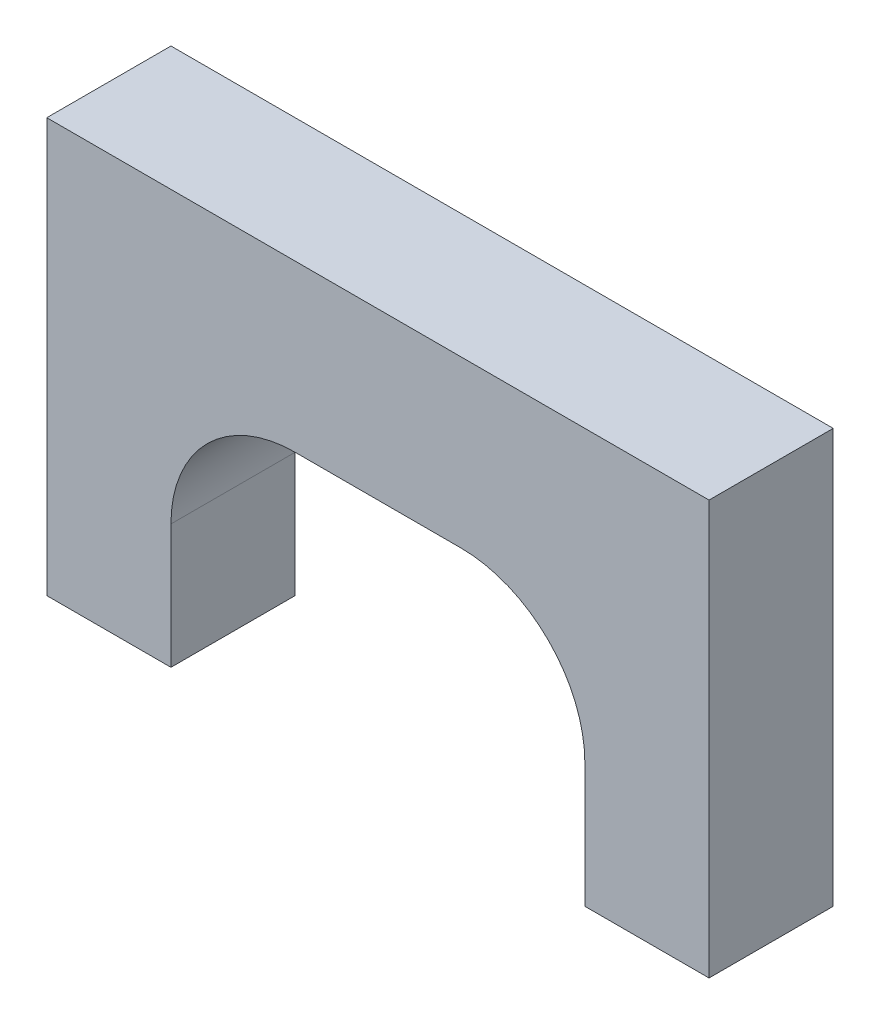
from build123d import *

# Parameters (mm, degrees)
SKETCH_1_W          = 16
SKETCH_1_H          = 10
EXTRUDE_1_DEPTH     = 3
SKETCH_2_W          = 10
SKETCH_2_H          = 12
CUT_EXTRUDE_1_DEPTH = 3
FILLET_1_R          = 3


with BuildPart() as part:
    # Sketch 1 → Extrude 1 (new body)
    with BuildSketch(Plane.XY):
        Rectangle(SKETCH_1_W, SKETCH_1_H)
    extrude(amount=EXTRUDE_1_DEPTH)

    # Sketch 2 → Cut-Extrude 1 (cut)
    with BuildSketch(Plane.XY.offset(3)):
        with Locations((0, -5)):
            Rectangle(SKETCH_2_W, SKETCH_2_H)
    extrude(amount=-CUT_EXTRUDE_1_DEPTH, mode=Mode.SUBTRACT)

    # Fillet 1
    fillet_1_edges = [part.edges().sort_by_distance(p)[0] for p in [
        (5, 1, 1.5),
        (-5, 1, 1.5),
    ]]
    fillet(fillet_1_edges, radius=FILLET_1_R)


solid = part.part
